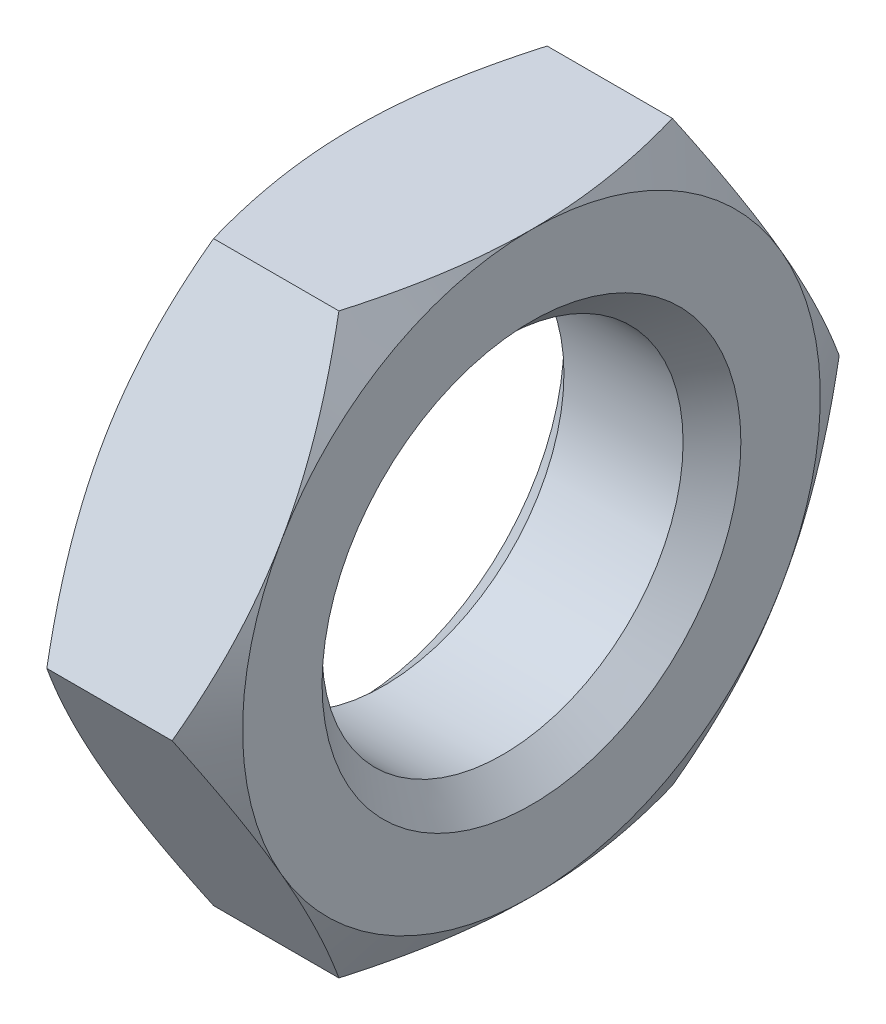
ISO-10303-21;
HEADER;
FILE_DESCRIPTION(('STEP AP214'),'2;1');
FILE_NAME('part.step','',(''),(''),'','','');
FILE_SCHEMA(('AUTOMOTIVE_DESIGN { 1 0 10303 214 1 1 1 1 }'));
ENDSEC;
DATA;
#1=APPLICATION_CONTEXT('core data for automotive mechanical design processes');
#2=APPLICATION_PROTOCOL_DEFINITION('international standard','automotive_design',2000,#1);
#3=PRODUCT_CONTEXT('',#1,'mechanical');
#4=PRODUCT('Part','Part','',(#3));
#5=PRODUCT_RELATED_PRODUCT_CATEGORY('part','',(#4));
#6=PRODUCT_DEFINITION_FORMATION('','',#4);
#7=PRODUCT_DEFINITION_CONTEXT('part definition',#1,'design');
#8=PRODUCT_DEFINITION('design','',#6,#7);
#9=PRODUCT_DEFINITION_SHAPE('','',#8);
#10=(LENGTH_UNIT() NAMED_UNIT(*) SI_UNIT(.MILLI.,.METRE.));
#11=(NAMED_UNIT(*) PLANE_ANGLE_UNIT() SI_UNIT($,.RADIAN.));
#12=(NAMED_UNIT(*) SI_UNIT($,.STERADIAN.) SOLID_ANGLE_UNIT());
#13=UNCERTAINTY_MEASURE_WITH_UNIT(LENGTH_MEASURE(1.E-05),#10,'distance_accuracy_value','');
#14=(GEOMETRIC_REPRESENTATION_CONTEXT(3) GLOBAL_UNCERTAINTY_ASSIGNED_CONTEXT((#13)) GLOBAL_UNIT_ASSIGNED_CONTEXT((#10,
#11,#12)) REPRESENTATION_CONTEXT('',''));
#15=CARTESIAN_POINT('',(0.,0.,0.));
#16=DIRECTION('',(0.,0.,1.));
#17=DIRECTION('',(1.,0.,0.));
#18=AXIS2_PLACEMENT_3D('',#15,#16,#17);
#19=CARTESIAN_POINT('',(2.45,4.,-2.3094010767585));
#20=DIRECTION('',(1.,0.,0.));
#21=DIRECTION('',(0.,0.,-1.));
#22=AXIS2_PLACEMENT_3D('',#19,#20,#21);
#23=PLANE('',#22);
#24=CARTESIAN_POINT('',(2.45,0.,0.));
#25=DIRECTION('',(1.,0.,0.));
#26=DIRECTION('',(0.,0.,-1.));
#27=AXIS2_PLACEMENT_3D('',#24,#25,#26);
#28=CIRCLE('',#27,2.9);
#29=CARTESIAN_POINT('',(2.45,0.,-2.9));
#30=VERTEX_POINT('',#29);
#31=EDGE_CURVE('E11',#30,#30,#28,.F.);
#32=ORIENTED_EDGE('',*,*,#31,.T.);
#33=EDGE_LOOP('',(#32));
#34=FACE_BOUND('',#33,.T.);
#35=CARTESIAN_POINT('',(2.45,0.,0.));
#36=DIRECTION('',(1.,0.,0.));
#37=DIRECTION('',(0.,0.,-1.));
#38=AXIS2_PLACEMENT_3D('',#35,#36,#37);
#39=CIRCLE('',#38,4.);
#40=CARTESIAN_POINT('',(2.45,-4.,0.));
#41=VERTEX_POINT('',#40);
#42=CARTESIAN_POINT('',(2.45,-2.,-3.46410161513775));
#43=VERTEX_POINT('',#42);
#44=EDGE_CURVE('E142',#41,#43,#39,.T.);
#45=ORIENTED_EDGE('',*,*,#44,.T.);
#46=CARTESIAN_POINT('',(2.45,2.,-3.46410161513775));
#47=VERTEX_POINT('',#46);
#48=EDGE_CURVE('E130',#43,#47,#39,.T.);
#49=ORIENTED_EDGE('',*,*,#48,.T.);
#50=CARTESIAN_POINT('',(2.45,4.,0.));
#51=VERTEX_POINT('',#50);
#52=EDGE_CURVE('E144',#47,#51,#39,.T.);
#53=ORIENTED_EDGE('',*,*,#52,.T.);
#54=CARTESIAN_POINT('',(2.45,2.,3.46410161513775));
#55=VERTEX_POINT('',#54);
#56=EDGE_CURVE('E55',#51,#55,#39,.T.);
#57=ORIENTED_EDGE('',*,*,#56,.T.);
#58=CARTESIAN_POINT('',(2.45,-2.,3.46410161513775));
#59=VERTEX_POINT('',#58);
#60=EDGE_CURVE('E63',#55,#59,#39,.T.);
#61=ORIENTED_EDGE('',*,*,#60,.T.);
#62=EDGE_CURVE('E166',#59,#41,#39,.T.);
#63=ORIENTED_EDGE('',*,*,#62,.T.);
#64=EDGE_LOOP('',(#45,#49,#53,#57,#61,#63));
#65=FACE_BOUND('',#64,.T.);
#66=ADVANCED_FACE('F39',(#34,#65),#23,.T.);
#67=CARTESIAN_POINT('',(0.,4.,-2.3094010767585));
#68=DIRECTION('',(1.,0.,0.));
#69=DIRECTION('',(0.,0.,-1.));
#70=AXIS2_PLACEMENT_3D('',#67,#68,#69);
#71=PLANE('',#70);
#72=CARTESIAN_POINT('',(0.,0.,0.));
#73=DIRECTION('',(1.,0.,0.));
#74=DIRECTION('',(0.,0.,-1.));
#75=AXIS2_PLACEMENT_3D('',#72,#73,#74);
#76=CIRCLE('',#75,2.9);
#77=CARTESIAN_POINT('',(0.,0.,-2.9));
#78=VERTEX_POINT('',#77);
#79=EDGE_CURVE('E164',#78,#78,#76,.T.);
#80=ORIENTED_EDGE('',*,*,#79,.T.);
#81=EDGE_LOOP('',(#80));
#82=FACE_BOUND('',#81,.T.);
#83=CARTESIAN_POINT('',(0.,0.,0.));
#84=DIRECTION('',(1.,0.,0.));
#85=DIRECTION('',(0.,0.,-1.));
#86=AXIS2_PLACEMENT_3D('',#83,#84,#85);
#87=CIRCLE('',#86,4.);
#88=CARTESIAN_POINT('',(0.,-2.,-3.46410161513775));
#89=VERTEX_POINT('',#88);
#90=CARTESIAN_POINT('',(0.,2.,-3.46410161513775));
#91=VERTEX_POINT('',#90);
#92=EDGE_CURVE('E173',#89,#91,#87,.T.);
#93=ORIENTED_EDGE('',*,*,#92,.F.);
#94=CARTESIAN_POINT('',(0.,-4.,0.));
#95=VERTEX_POINT('',#94);
#96=EDGE_CURVE('E319',#95,#89,#87,.T.);
#97=ORIENTED_EDGE('',*,*,#96,.F.);
#98=CARTESIAN_POINT('',(0.,-2.,3.46410161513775));
#99=VERTEX_POINT('',#98);
#100=EDGE_CURVE('E322',#99,#95,#87,.T.);
#101=ORIENTED_EDGE('',*,*,#100,.F.);
#102=CARTESIAN_POINT('',(0.,2.,3.46410161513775));
#103=VERTEX_POINT('',#102);
#104=EDGE_CURVE('E327',#103,#99,#87,.T.);
#105=ORIENTED_EDGE('',*,*,#104,.F.);
#106=CARTESIAN_POINT('',(0.,4.,0.));
#107=VERTEX_POINT('',#106);
#108=EDGE_CURVE('E178',#107,#103,#87,.T.);
#109=ORIENTED_EDGE('',*,*,#108,.F.);
#110=EDGE_CURVE('E174',#91,#107,#87,.T.);
#111=ORIENTED_EDGE('',*,*,#110,.F.);
#112=EDGE_LOOP('',(#93,#97,#101,#105,#109,#111));
#113=FACE_BOUND('',#112,.T.);
#114=ADVANCED_FACE('F320',(#82,#113),#71,.F.);
#115=CARTESIAN_POINT('',(2.45,0.,0.));
#116=DIRECTION('',(-1.,0.,0.));
#117=DIRECTION('',(0.,0.,1.));
#118=AXIS2_PLACEMENT_3D('',#115,#116,#117);
#119=CYLINDRICAL_SURFACE('',#118,2.5);
#120=CARTESIAN_POINT('',(0.400000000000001,0.,0.));
#121=DIRECTION('',(1.,0.,0.));
#122=DIRECTION('',(0.,0.,-1.));
#123=AXIS2_PLACEMENT_3D('',#120,#121,#122);
#124=CIRCLE('',#123,2.5);
#125=CARTESIAN_POINT('',(0.400000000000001,0.,-2.5));
#126=VERTEX_POINT('',#125);
#127=EDGE_CURVE('E48',#126,#126,#124,.F.);
#128=ORIENTED_EDGE('',*,*,#127,.T.);
#129=EDGE_LOOP('',(#128));
#130=FACE_BOUND('',#129,.T.);
#131=CARTESIAN_POINT('',(2.05,0.,0.));
#132=DIRECTION('',(1.,0.,0.));
#133=DIRECTION('',(0.,0.,-1.));
#134=AXIS2_PLACEMENT_3D('',#131,#132,#133);
#135=CIRCLE('',#134,2.5);
#136=CARTESIAN_POINT('',(2.05,0.,-2.5));
#137=VERTEX_POINT('',#136);
#138=EDGE_CURVE('E389',#137,#137,#135,.T.);
#139=ORIENTED_EDGE('',*,*,#138,.T.);
#140=EDGE_LOOP('',(#139));
#141=FACE_BOUND('',#140,.T.);
#142=ADVANCED_FACE('F234',(#130,#141),#119,.F.);
#143=CARTESIAN_POINT('',(0.,0.,0.));
#144=DIRECTION('',(1.,0.,0.));
#145=DIRECTION('',(0.,0.,-1.));
#146=AXIS2_PLACEMENT_3D('',#143,#144,#145);
#147=CONICAL_SURFACE('',#146,4.,1.0471975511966);
#148=CARTESIAN_POINT('',(0.357332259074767,-4.0002,-2.30928560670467));
#149=CARTESIAN_POINT('',(0.298717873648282,-3.82442084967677,-2.4107717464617));
#150=CARTESIAN_POINT('',(0.245410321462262,-3.64712438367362,-2.51313390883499));
#151=CARTESIAN_POINT('',(0.152361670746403,-3.28946140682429,-2.71963072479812));
#152=CARTESIAN_POINT('',(0.112653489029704,-3.10908854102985,-2.82376904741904));
#153=CARTESIAN_POINT('',(0.0508422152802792,-2.75057818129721,-3.03075510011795));
#154=CARTESIAN_POINT('',(0.0283277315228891,-2.57249584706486,-3.13357098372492));
#155=CARTESIAN_POINT('',(0.00145062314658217,-2.21549328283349,-3.33968651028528));
#156=CARTESIAN_POINT('',(-0.00293425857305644,-2.0365743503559,-3.44298540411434));
#157=CARTESIAN_POINT('',(0.00619007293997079,-1.70225715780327,-3.63600352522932));
#158=CARTESIAN_POINT('',(0.0174589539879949,-1.54680884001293,-3.72575165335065));
#159=CARTESIAN_POINT('',(0.053173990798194,-1.23692494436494,-3.90466320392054));
#160=CARTESIAN_POINT('',(0.0776323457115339,-1.08249043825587,-3.99382600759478));
#161=CARTESIAN_POINT('',(0.13877606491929,-0.771967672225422,-4.17310641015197));
#162=CARTESIAN_POINT('',(0.175720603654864,-0.615918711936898,-4.26320131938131));
#163=CARTESIAN_POINT('',(0.259570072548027,-0.306148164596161,-4.4420474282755));
#164=CARTESIAN_POINT('',(0.30645530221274,-0.152422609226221,-4.53080091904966));
#165=CARTESIAN_POINT('',(0.357332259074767,0.000199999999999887,-4.61891762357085));
#166=B_SPLINE_CURVE_WITH_KNOTS('',3,(#148,#149,#150,#151,#152,#153,#154,#155,#156,#157,#158,
#159,#160,#161,#162,#163,#164,#165),.UNSPECIFIED.,.F.,.F.,(4,2,2,2,2,2,2,2,4),(0.,
0.634047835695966,1.26961969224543,1.88946157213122,2.50854226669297,3.04757825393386,
3.58711366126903,4.13861653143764,4.68903648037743),.UNSPECIFIED.);
#167=CARTESIAN_POINT('',(0.357265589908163,0.,-4.61880215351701));
#168=VERTEX_POINT('',#167);
#169=EDGE_CURVE('E335',#89,#168,#166,.T.);
#170=ORIENTED_EDGE('',*,*,#169,.F.);
#171=ORIENTED_EDGE('',*,*,#92,.T.);
#172=CARTESIAN_POINT('',(0.357332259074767,-0.000200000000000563,-4.61891762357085));
#173=CARTESIAN_POINT('',(0.298717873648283,0.175579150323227,-4.51743148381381));
#174=CARTESIAN_POINT('',(0.245410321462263,0.35287561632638,-4.41506932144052));
#175=CARTESIAN_POINT('',(0.152361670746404,0.710538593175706,-4.2085725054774));
#176=CARTESIAN_POINT('',(0.112653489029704,0.89091145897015,-4.10443418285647));
#177=CARTESIAN_POINT('',(0.0508422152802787,1.24942181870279,-3.89744813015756));
#178=CARTESIAN_POINT('',(0.0283277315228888,1.42750415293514,-3.79463224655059));
#179=CARTESIAN_POINT('',(0.00145062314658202,1.78450671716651,-3.58851671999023));
#180=CARTESIAN_POINT('',(-0.00293425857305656,1.9634256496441,-3.48521782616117));
#181=CARTESIAN_POINT('',(0.0061900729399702,2.29774284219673,-3.29219970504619));
#182=CARTESIAN_POINT('',(0.0174589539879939,2.45319115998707,-3.20245157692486));
#183=CARTESIAN_POINT('',(0.0531739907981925,2.76307505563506,-3.02354002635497));
#184=CARTESIAN_POINT('',(0.0776323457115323,2.91750956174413,-2.93437722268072));
#185=CARTESIAN_POINT('',(0.138776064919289,3.22803232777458,-2.75509682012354));
#186=CARTESIAN_POINT('',(0.175720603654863,3.3840812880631,-2.6650019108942));
#187=CARTESIAN_POINT('',(0.259570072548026,3.69385183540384,-2.48615580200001));
#188=CARTESIAN_POINT('',(0.306455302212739,3.84757739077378,-2.39740231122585));
#189=CARTESIAN_POINT('',(0.357332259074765,4.0002,-2.30928560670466));
#190=B_SPLINE_CURVE_WITH_KNOTS('',3,(#172,#173,#174,#175,#176,#177,#178,#179,#180,#181,#182,
#183,#184,#185,#186,#187,#188,#189),.UNSPECIFIED.,.F.,.F.,(4,2,2,2,2,2,2,2,4),(0.,
0.634047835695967,1.26961969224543,1.88946157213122,2.50854226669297,3.04757825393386,
3.58711366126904,4.13861653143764,4.68903648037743),.UNSPECIFIED.);
#191=EDGE_CURVE('E215',#168,#91,#190,.T.);
#192=ORIENTED_EDGE('',*,*,#191,.F.);
#193=EDGE_LOOP('',(#170,#171,#192));
#194=FACE_BOUND('',#193,.T.);
#195=ADVANCED_FACE('F194',(#194),#147,.T.);
#196=ORIENTED_EDGE('',*,*,#96,.T.);
#197=CARTESIAN_POINT('',(0.357265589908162,-4.,-2.3094010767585));
#198=VERTEX_POINT('',#197);
#199=EDGE_CURVE('E156',#198,#89,#166,.T.);
#200=ORIENTED_EDGE('',*,*,#199,.F.);
#201=CARTESIAN_POINT('',(1.9728542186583,-4.,-6.24604925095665));
#202=CARTESIAN_POINT('',(1.88776121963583,-4.,-6.07098442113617));
#203=CARTESIAN_POINT('',(1.80347183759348,-4.,-5.89552228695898));
#204=CARTESIAN_POINT('',(1.63695141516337,-4.,-5.54359229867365));
#205=CARTESIAN_POINT('',(1.55472069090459,-4.,-5.36712429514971));
#206=CARTESIAN_POINT('',(1.39236406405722,-4.,-5.01208252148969));
#207=CARTESIAN_POINT('',(1.31225169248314,-4.,-4.83350254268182));
#208=CARTESIAN_POINT('',(1.15524865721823,-4.,-4.47493714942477));
#209=CARTESIAN_POINT('',(1.07835784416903,-4.,-4.29495180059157));
#210=CARTESIAN_POINT('',(0.926171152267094,-4.,-3.92730851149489));
#211=CARTESIAN_POINT('',(0.851012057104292,-4.,-3.73959364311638));
#212=CARTESIAN_POINT('',(0.706279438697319,-4.,-3.36198352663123));
#213=CARTESIAN_POINT('',(0.636706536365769,-4.,-3.17208803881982));
#214=CARTESIAN_POINT('',(0.504941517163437,-4.,-2.79015649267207));
#215=CARTESIAN_POINT('',(0.442734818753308,-4.,-2.59812551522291));
#216=CARTESIAN_POINT('',(0.327670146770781,-4.,-2.21130897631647));
#217=CARTESIAN_POINT('',(0.274809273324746,-4.,-2.0165242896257));
#218=CARTESIAN_POINT('',(0.181229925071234,-4.,-1.62518488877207));
#219=CARTESIAN_POINT('',(0.14044374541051,-4.,-1.42864666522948));
#220=CARTESIAN_POINT('',(0.0732864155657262,-4.,-1.03308153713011));
#221=CARTESIAN_POINT('',(0.046913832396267,-4.,-0.834054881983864));
#222=CARTESIAN_POINT('',(0.0110310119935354,-4.,-0.437123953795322));
#223=CARTESIAN_POINT('',(0.00130070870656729,-4.,-0.239240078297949));
#224=CARTESIAN_POINT('',(-0.00105456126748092,-4.,0.156646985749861));
#225=CARTESIAN_POINT('',(0.00632068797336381,-4.,0.354650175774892));
#226=CARTESIAN_POINT('',(0.0327353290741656,-4.,0.689547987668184));
#227=CARTESIAN_POINT('',(0.0475676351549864,-4.,0.826795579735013));
#228=CARTESIAN_POINT('',(0.0845503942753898,-4.,1.10030788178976));
#229=CARTESIAN_POINT('',(0.106701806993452,-4.,1.23657246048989));
#230=CARTESIAN_POINT('',(0.182972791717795,-4.,1.64369860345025));
#231=CARTESIAN_POINT('',(0.246895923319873,-4.,1.91274523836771));
#232=CARTESIAN_POINT('',(0.358016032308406,-4.,2.31509056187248));
#233=CARTESIAN_POINT('',(0.398118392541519,-4.,2.45046771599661));
#234=CARTESIAN_POINT('',(0.482557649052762,-4.,2.7199076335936));
#235=CARTESIAN_POINT('',(0.52689457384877,-4.,2.85397038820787));
#236=CARTESIAN_POINT('',(0.619085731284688,-4.,3.12082252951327));
#237=CARTESIAN_POINT('',(0.666938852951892,-4.,3.25361230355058));
#238=CARTESIAN_POINT('',(0.765592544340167,-4.,3.51808713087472));
#239=CARTESIAN_POINT('',(0.816393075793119,-4.,3.64977219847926));
#240=CARTESIAN_POINT('',(0.941692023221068,-4.,3.96571232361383));
#241=CARTESIAN_POINT('',(1.01740004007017,-4.,4.14948684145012));
#242=CARTESIAN_POINT('',(1.17263155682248,-4.,4.51542233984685));
#243=CARTESIAN_POINT('',(1.25215531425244,-4.,4.69758321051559));
#244=CARTESIAN_POINT('',(1.41423451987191,-4.,5.06059627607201));
#245=CARTESIAN_POINT('',(1.49679064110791,-4.,5.24144816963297));
#246=CARTESIAN_POINT('',(1.66431834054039,-4.,5.6020315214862));
#247=CARTESIAN_POINT('',(1.74928997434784,-4.,5.7817629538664));
#248=CARTESIAN_POINT('',(2.00730427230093,-4.,6.31997467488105));
#249=CARTESIAN_POINT('',(2.18325862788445,-4.,6.67705811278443));
#250=CARTESIAN_POINT('',(2.54034036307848,-4.,7.38855163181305));
#251=CARTESIAN_POINT('',(2.72146705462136,-4.,7.7429620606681));
#252=CARTESIAN_POINT('',(3.07151620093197,-4.,8.41921660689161));
#253=CARTESIAN_POINT('',(3.24013422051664,-4.,8.7412186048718));
#254=CARTESIAN_POINT('',(3.57966083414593,-4.,9.38402672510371));
#255=CARTESIAN_POINT('',(3.7505695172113,-4.,9.70483280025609));
#256=CARTESIAN_POINT('',(4.09367105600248,-4.,10.344663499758));
#257=CARTESIAN_POINT('',(4.26585931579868,-4.,10.6636905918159));
#258=CARTESIAN_POINT('',(4.61159585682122,-4.,11.3009829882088));
#259=CARTESIAN_POINT('',(4.78514405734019,-4.,11.6192483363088));
#260=CARTESIAN_POINT('',(4.9591976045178,-4.,11.937235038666));
#261=B_SPLINE_CURVE_WITH_KNOTS('',3,(#201,#202,#203,#204,#205,#206,#207,#208,#209,#210,#211,
#212,#213,#214,#215,#216,#217,#218,#219,#220,#221,#222,#223,#224,#225,#226,#227,#228,#229,#230,
#231,#232,#233,#234,#235,#236,#237,#238,#239,#240,#241,#242,#243,#244,#245,#246,#247,#248,#249,
#250,#251,#252,#253,#254,#255,#256,#257,#258,#259,#260),.UNSPECIFIED.,.F.,.F.,(4,2,2,2,2,2,2,2,
2,2,2,2,2,2,2,2,2,2,2,2,2,2,2,2,2,2,2,2,2,4),(0.,0.583956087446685,1.16800130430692,
1.75515482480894,2.34228109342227,2.94881918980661,3.55542461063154,4.16080842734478,
4.76600407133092,5.36773905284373,5.9694141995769,6.56306986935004,7.15673303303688,
7.57067316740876,7.98466759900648,8.81309821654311,9.2366372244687,9.66017908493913,
10.0835876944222,10.5069908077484,11.1032061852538,11.6994618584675,12.2958506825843,
12.8922532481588,14.086422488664,15.2804336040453,16.3708597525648,17.4613284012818,
18.5489109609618,19.6364294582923),.UNSPECIFIED.);
#262=EDGE_CURVE('E177',#95,#198,#261,.F.);
#263=ORIENTED_EDGE('',*,*,#262,.F.);
#264=EDGE_LOOP('',(#196,#200,#263));
#265=FACE_BOUND('',#264,.T.);
#266=ADVANCED_FACE('F352',(#265),#147,.T.);
#267=CARTESIAN_POINT('',(1.225,0.,0.));
#268=DIRECTION('',(-1.,0.,0.));
#269=DIRECTION('',(0.,0.,1.));
#270=AXIS2_PLACEMENT_3D('',#267,#268,#269);
#271=CONICAL_SURFACE('',#270,6.12176223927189,1.0471975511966);
#272=CARTESIAN_POINT('',(2.09266774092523,0.000199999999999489,-4.61891762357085));
#273=CARTESIAN_POINT('',(2.15128212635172,-0.175579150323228,-4.51743148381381));
#274=CARTESIAN_POINT('',(2.20458967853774,-0.352875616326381,-4.41506932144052));
#275=CARTESIAN_POINT('',(2.2976383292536,-0.710538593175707,-4.2085725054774));
#276=CARTESIAN_POINT('',(2.3373465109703,-0.890911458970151,-4.10443418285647));
#277=CARTESIAN_POINT('',(2.39915778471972,-1.24942181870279,-3.89744813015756));
#278=CARTESIAN_POINT('',(2.42167226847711,-1.42750415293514,-3.79463224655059));
#279=CARTESIAN_POINT('',(2.44854937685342,-1.78450671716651,-3.58851671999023));
#280=CARTESIAN_POINT('',(2.45293425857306,-1.9634256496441,-3.48521782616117));
#281=CARTESIAN_POINT('',(2.44380992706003,-2.29774284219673,-3.29219970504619));
#282=CARTESIAN_POINT('',(2.43254104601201,-2.45319115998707,-3.20245157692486));
#283=CARTESIAN_POINT('',(2.39682600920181,-2.76307505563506,-3.02354002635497));
#284=CARTESIAN_POINT('',(2.37236765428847,-2.91750956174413,-2.93437722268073));
#285=CARTESIAN_POINT('',(2.31122393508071,-3.22803232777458,-2.75509682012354));
#286=CARTESIAN_POINT('',(2.27427939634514,-3.3840812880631,-2.6650019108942));
#287=CARTESIAN_POINT('',(2.19042992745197,-3.69385183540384,-2.48615580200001));
#288=CARTESIAN_POINT('',(2.14354469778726,-3.84757739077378,-2.39740231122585));
#289=CARTESIAN_POINT('',(2.09266774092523,-4.0002,-2.30928560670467));
#290=B_SPLINE_CURVE_WITH_KNOTS('',3,(#272,#273,#274,#275,#276,#277,#278,#279,#280,#281,#282,
#283,#284,#285,#286,#287,#288,#289),.UNSPECIFIED.,.F.,.F.,(4,2,2,2,2,2,2,2,4),(0.,
0.634047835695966,1.26961969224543,1.88946157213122,2.50854226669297,3.04757825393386,
3.58711366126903,4.13861653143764,4.68903648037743),.UNSPECIFIED.);
#291=CARTESIAN_POINT('',(2.09273441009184,-4.,-2.3094010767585));
#292=VERTEX_POINT('',#291);
#293=EDGE_CURVE('E147',#43,#292,#290,.T.);
#294=ORIENTED_EDGE('',*,*,#293,.F.);
#295=ORIENTED_EDGE('',*,*,#44,.F.);
#296=CARTESIAN_POINT('',(0.477145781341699,-4.,-6.24604925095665));
#297=CARTESIAN_POINT('',(0.562238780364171,-4.,-6.07098442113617));
#298=CARTESIAN_POINT('',(0.646528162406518,-4.,-5.89552228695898));
#299=CARTESIAN_POINT('',(0.813048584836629,-4.,-5.54359229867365));
#300=CARTESIAN_POINT('',(0.89527930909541,-4.,-5.36712429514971));
#301=CARTESIAN_POINT('',(1.05763593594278,-4.,-5.01208252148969));
#302=CARTESIAN_POINT('',(1.13774830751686,-4.,-4.83350254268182));
#303=CARTESIAN_POINT('',(1.29475134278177,-4.,-4.47493714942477));
#304=CARTESIAN_POINT('',(1.37164215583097,-4.,-4.29495180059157));
#305=CARTESIAN_POINT('',(1.52382884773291,-4.,-3.92730851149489));
#306=CARTESIAN_POINT('',(1.59898794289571,-4.,-3.73959364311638));
#307=CARTESIAN_POINT('',(1.74372056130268,-4.,-3.36198352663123));
#308=CARTESIAN_POINT('',(1.81329346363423,-4.,-3.17208803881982));
#309=CARTESIAN_POINT('',(1.94505848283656,-4.,-2.79015649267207));
#310=CARTESIAN_POINT('',(2.00726518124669,-4.,-2.59812551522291));
#311=CARTESIAN_POINT('',(2.12232985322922,-4.,-2.21130897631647));
#312=CARTESIAN_POINT('',(2.17519072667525,-4.,-2.0165242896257));
#313=CARTESIAN_POINT('',(2.26877007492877,-4.,-1.62518488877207));
#314=CARTESIAN_POINT('',(2.30955625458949,-4.,-1.42864666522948));
#315=CARTESIAN_POINT('',(2.37671358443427,-4.,-1.03308153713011));
#316=CARTESIAN_POINT('',(2.40308616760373,-4.,-0.834054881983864));
#317=CARTESIAN_POINT('',(2.43896898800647,-4.,-0.437123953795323));
#318=CARTESIAN_POINT('',(2.44869929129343,-4.,-0.239240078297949));
#319=CARTESIAN_POINT('',(2.45105456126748,-4.,0.15664698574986));
#320=CARTESIAN_POINT('',(2.44367931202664,-4.,0.354650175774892));
#321=CARTESIAN_POINT('',(2.41726467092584,-4.,0.689547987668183));
#322=CARTESIAN_POINT('',(2.40243236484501,-4.,0.826795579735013));
#323=CARTESIAN_POINT('',(2.36544960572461,-4.,1.10030788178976));
#324=CARTESIAN_POINT('',(2.34329819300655,-4.,1.23657246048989));
#325=CARTESIAN_POINT('',(2.2670272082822,-4.,1.64369860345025));
#326=CARTESIAN_POINT('',(2.20310407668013,-4.,1.91274523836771));
#327=CARTESIAN_POINT('',(2.09198396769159,-4.,2.31509056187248));
#328=CARTESIAN_POINT('',(2.05188160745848,-4.,2.45046771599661));
#329=CARTESIAN_POINT('',(1.96744235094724,-4.,2.7199076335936));
#330=CARTESIAN_POINT('',(1.92310542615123,-4.,2.85397038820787));
#331=CARTESIAN_POINT('',(1.83091426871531,-4.,3.12082252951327));
#332=CARTESIAN_POINT('',(1.78306114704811,-4.,3.25361230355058));
#333=CARTESIAN_POINT('',(1.68440745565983,-4.,3.51808713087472));
#334=CARTESIAN_POINT('',(1.63360692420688,-4.,3.64977219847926));
#335=CARTESIAN_POINT('',(1.50830797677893,-4.,3.96571232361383));
#336=CARTESIAN_POINT('',(1.43259995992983,-4.,4.14948684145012));
#337=CARTESIAN_POINT('',(1.27736844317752,-4.,4.51542233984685));
#338=CARTESIAN_POINT('',(1.19784468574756,-4.,4.69758321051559));
#339=CARTESIAN_POINT('',(1.03576548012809,-4.,5.06059627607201));
#340=CARTESIAN_POINT('',(0.953209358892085,-4.,5.24144816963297));
#341=CARTESIAN_POINT('',(0.785681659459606,-4.,5.6020315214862));
#342=CARTESIAN_POINT('',(0.700710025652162,-4.,5.7817629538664));
#343=CARTESIAN_POINT('',(0.442695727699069,-4.,6.31997467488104));
#344=CARTESIAN_POINT('',(0.266741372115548,-4.,6.67705811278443));
#345=CARTESIAN_POINT('',(-0.0903403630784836,-4.,7.38855163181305));
#346=CARTESIAN_POINT('',(-0.27146705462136,-4.,7.7429620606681));
#347=CARTESIAN_POINT('',(-0.621516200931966,-4.,8.41921660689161));
#348=CARTESIAN_POINT('',(-0.790134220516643,-4.,8.7412186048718));
#349=CARTESIAN_POINT('',(-1.12966083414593,-4.,9.38402672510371));
#350=CARTESIAN_POINT('',(-1.30056951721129,-4.,9.70483280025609));
#351=CARTESIAN_POINT('',(-1.64367105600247,-4.,10.344663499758));
#352=CARTESIAN_POINT('',(-1.81585931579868,-4.,10.6636905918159));
#353=CARTESIAN_POINT('',(-2.16159585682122,-4.,11.3009829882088));
#354=CARTESIAN_POINT('',(-2.33514405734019,-4.,11.6192483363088));
#355=CARTESIAN_POINT('',(-2.5091976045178,-4.,11.937235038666));
#356=B_SPLINE_CURVE_WITH_KNOTS('',3,(#296,#297,#298,#299,#300,#301,#302,#303,#304,#305,#306,
#307,#308,#309,#310,#311,#312,#313,#314,#315,#316,#317,#318,#319,#320,#321,#322,#323,#324,#325,
#326,#327,#328,#329,#330,#331,#332,#333,#334,#335,#336,#337,#338,#339,#340,#341,#342,#343,#344,
#345,#346,#347,#348,#349,#350,#351,#352,#353,#354,#355),.UNSPECIFIED.,.F.,.F.,(4,2,2,2,2,2,2,2,
2,2,2,2,2,2,2,2,2,2,2,2,2,2,2,2,2,2,2,2,2,4),(0.,0.583956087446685,1.16800130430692,
1.75515482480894,2.34228109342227,2.9488191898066,3.55542461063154,4.16080842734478,
4.76600407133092,5.36773905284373,5.9694141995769,6.56306986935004,7.15673303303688,
7.57067316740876,7.98466759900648,8.81309821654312,9.2366372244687,9.66017908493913,
10.0835876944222,10.5069908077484,11.1032061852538,11.6994618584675,12.2958506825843,
12.8922532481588,14.086422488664,15.2804336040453,16.3708597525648,17.4613284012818,
18.5489109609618,19.6364294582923),.UNSPECIFIED.);
#357=EDGE_CURVE('E151',#292,#41,#356,.T.);
#358=ORIENTED_EDGE('',*,*,#357,.F.);
#359=EDGE_LOOP('',(#294,#295,#358));
#360=FACE_BOUND('',#359,.T.);
#361=ADVANCED_FACE('F148',(#360),#271,.T.);
#362=ORIENTED_EDGE('',*,*,#48,.F.);
#363=CARTESIAN_POINT('',(2.09273441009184,0.,-4.61880215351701));
#364=VERTEX_POINT('',#363);
#365=EDGE_CURVE('E134',#364,#43,#290,.T.);
#366=ORIENTED_EDGE('',*,*,#365,.F.);
#367=CARTESIAN_POINT('',(2.09266774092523,4.0002,-2.30928560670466));
#368=CARTESIAN_POINT('',(2.15128212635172,3.82442084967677,-2.4107717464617));
#369=CARTESIAN_POINT('',(2.20458967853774,3.64712438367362,-2.51313390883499));
#370=CARTESIAN_POINT('',(2.2976383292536,3.28946140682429,-2.71963072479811));
#371=CARTESIAN_POINT('',(2.3373465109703,3.10908854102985,-2.82376904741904));
#372=CARTESIAN_POINT('',(2.39915778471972,2.75057818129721,-3.03075510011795));
#373=CARTESIAN_POINT('',(2.42167226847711,2.57249584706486,-3.13357098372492));
#374=CARTESIAN_POINT('',(2.44854937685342,2.21549328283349,-3.33968651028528));
#375=CARTESIAN_POINT('',(2.45293425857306,2.0365743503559,-3.44298540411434));
#376=CARTESIAN_POINT('',(2.44380992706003,1.70225715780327,-3.63600352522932));
#377=CARTESIAN_POINT('',(2.43254104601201,1.54680884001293,-3.72575165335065));
#378=CARTESIAN_POINT('',(2.39682600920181,1.23692494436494,-3.90466320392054));
#379=CARTESIAN_POINT('',(2.37236765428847,1.08249043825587,-3.99382600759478));
#380=CARTESIAN_POINT('',(2.31122393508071,0.771967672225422,-4.17310641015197));
#381=CARTESIAN_POINT('',(2.27427939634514,0.615918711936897,-4.26320131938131));
#382=CARTESIAN_POINT('',(2.19042992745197,0.30614816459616,-4.4420474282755));
#383=CARTESIAN_POINT('',(2.14354469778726,0.15242260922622,-4.53080091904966));
#384=CARTESIAN_POINT('',(2.09266774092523,-0.000200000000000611,-4.61891762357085));
#385=B_SPLINE_CURVE_WITH_KNOTS('',3,(#367,#368,#369,#370,#371,#372,#373,#374,#375,#376,#377,
#378,#379,#380,#381,#382,#383,#384),.UNSPECIFIED.,.F.,.F.,(4,2,2,2,2,2,2,2,4),(0.,
0.634047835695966,1.26961969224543,1.88946157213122,2.50854226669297,3.04757825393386,
3.58711366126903,4.13861653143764,4.68903648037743),.UNSPECIFIED.);
#386=EDGE_CURVE('E136',#47,#364,#385,.T.);
#387=ORIENTED_EDGE('',*,*,#386,.F.);
#388=EDGE_LOOP('',(#362,#366,#387));
#389=FACE_BOUND('',#388,.T.);
#390=ADVANCED_FACE('F132',(#389),#271,.T.);
#391=ORIENTED_EDGE('',*,*,#100,.T.);
#392=CARTESIAN_POINT('',(0.357265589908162,-4.,2.3094010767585));
#393=VERTEX_POINT('',#392);
#394=EDGE_CURVE('E187',#393,#95,#261,.F.);
#395=ORIENTED_EDGE('',*,*,#394,.F.);
#396=CARTESIAN_POINT('',(0.357332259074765,0.000200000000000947,4.61891762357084));
#397=CARTESIAN_POINT('',(0.298717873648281,-0.175579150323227,4.5174314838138));
#398=CARTESIAN_POINT('',(0.245410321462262,-0.35287561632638,4.41506932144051));
#399=CARTESIAN_POINT('',(0.152361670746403,-0.710538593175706,4.20857250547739));
#400=CARTESIAN_POINT('',(0.112653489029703,-0.89091145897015,4.10443418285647));
#401=CARTESIAN_POINT('',(0.0508422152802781,-1.24942181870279,3.89744813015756));
#402=CARTESIAN_POINT('',(0.0283277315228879,-1.42750415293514,3.79463224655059));
#403=CARTESIAN_POINT('',(0.0014506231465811,-1.78450671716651,3.58851671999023));
#404=CARTESIAN_POINT('',(-0.00293425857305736,-1.9634256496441,3.48521782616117));
#405=CARTESIAN_POINT('',(0.0061900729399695,-2.29774284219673,3.29219970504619));
#406=CARTESIAN_POINT('',(0.0174589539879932,-2.45319115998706,3.20245157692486));
#407=CARTESIAN_POINT('',(0.0531739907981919,-2.76307505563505,3.02354002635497));
#408=CARTESIAN_POINT('',(0.0776323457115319,-2.91750956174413,2.93437722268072));
#409=CARTESIAN_POINT('',(0.138776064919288,-3.22803232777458,2.75509682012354));
#410=CARTESIAN_POINT('',(0.175720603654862,-3.3840812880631,2.6650019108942));
#411=CARTESIAN_POINT('',(0.259570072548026,-3.69385183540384,2.48615580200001));
#412=CARTESIAN_POINT('',(0.306455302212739,-3.84757739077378,2.39740231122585));
#413=CARTESIAN_POINT('',(0.357332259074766,-4.0002,2.30928560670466));
#414=B_SPLINE_CURVE_WITH_KNOTS('',3,(#396,#397,#398,#399,#400,#401,#402,#403,#404,#405,#406,
#407,#408,#409,#410,#411,#412,#413),.UNSPECIFIED.,.F.,.F.,(4,2,2,2,2,2,2,2,4),(0.,
0.634047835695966,1.26961969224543,1.88946157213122,2.50854226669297,3.04757825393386,
3.58711366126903,4.13861653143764,4.68903648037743),.UNSPECIFIED.);
#415=EDGE_CURVE('E188',#99,#393,#414,.T.);
#416=ORIENTED_EDGE('',*,*,#415,.F.);
#417=EDGE_LOOP('',(#391,#395,#416));
#418=FACE_BOUND('',#417,.T.);
#419=ADVANCED_FACE('F351',(#418),#147,.T.);
#420=CARTESIAN_POINT('',(2.09273441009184,-4.,2.3094010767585));
#421=VERTEX_POINT('',#420);
#422=EDGE_CURVE('E216',#41,#421,#356,.T.);
#423=ORIENTED_EDGE('',*,*,#422,.F.);
#424=ORIENTED_EDGE('',*,*,#62,.F.);
#425=CARTESIAN_POINT('',(2.09266774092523,-4.0002,2.30928560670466));
#426=CARTESIAN_POINT('',(2.15128212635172,-3.82442084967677,2.4107717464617));
#427=CARTESIAN_POINT('',(2.20458967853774,-3.64712438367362,2.51313390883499));
#428=CARTESIAN_POINT('',(2.2976383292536,-3.28946140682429,2.71963072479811));
#429=CARTESIAN_POINT('',(2.3373465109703,-3.10908854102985,2.82376904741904));
#430=CARTESIAN_POINT('',(2.39915778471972,-2.75057818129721,3.03075510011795));
#431=CARTESIAN_POINT('',(2.42167226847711,-2.57249584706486,3.13357098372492));
#432=CARTESIAN_POINT('',(2.44854937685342,-2.21549328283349,3.33968651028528));
#433=CARTESIAN_POINT('',(2.45293425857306,-2.0365743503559,3.44298540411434));
#434=CARTESIAN_POINT('',(2.44380992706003,-1.70225715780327,3.63600352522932));
#435=CARTESIAN_POINT('',(2.43254104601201,-1.54680884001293,3.72575165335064));
#436=CARTESIAN_POINT('',(2.39682600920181,-1.23692494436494,3.90466320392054));
#437=CARTESIAN_POINT('',(2.37236765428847,-1.08249043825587,3.99382600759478));
#438=CARTESIAN_POINT('',(2.31122393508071,-0.771967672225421,4.17310641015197));
#439=CARTESIAN_POINT('',(2.27427939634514,-0.615918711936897,4.26320131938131));
#440=CARTESIAN_POINT('',(2.19042992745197,-0.30614816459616,4.4420474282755));
#441=CARTESIAN_POINT('',(2.14354469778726,-0.15242260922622,4.53080091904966));
#442=CARTESIAN_POINT('',(2.09266774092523,0.000200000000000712,4.61891762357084));
#443=B_SPLINE_CURVE_WITH_KNOTS('',3,(#425,#426,#427,#428,#429,#430,#431,#432,#433,#434,#435,
#436,#437,#438,#439,#440,#441,#442),.UNSPECIFIED.,.F.,.F.,(4,2,2,2,2,2,2,2,4),(0.,
0.634047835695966,1.26961969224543,1.88946157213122,2.50854226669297,3.04757825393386,
3.58711366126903,4.13861653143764,4.68903648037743),.UNSPECIFIED.);
#444=EDGE_CURVE('E247',#421,#59,#443,.T.);
#445=ORIENTED_EDGE('',*,*,#444,.F.);
#446=EDGE_LOOP('',(#423,#424,#445));
#447=FACE_BOUND('',#446,.T.);
#448=ADVANCED_FACE('F431',(#447),#271,.T.);
#449=ORIENTED_EDGE('',*,*,#104,.T.);
#450=CARTESIAN_POINT('',(0.357265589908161,0.,4.618802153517));
#451=VERTEX_POINT('',#450);
#452=EDGE_CURVE('E288',#451,#99,#414,.T.);
#453=ORIENTED_EDGE('',*,*,#452,.F.);
#454=CARTESIAN_POINT('',(0.357332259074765,4.0002,2.30928560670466));
#455=CARTESIAN_POINT('',(0.298717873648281,3.82442084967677,2.4107717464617));
#456=CARTESIAN_POINT('',(0.245410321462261,3.64712438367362,2.51313390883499));
#457=CARTESIAN_POINT('',(0.152361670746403,3.28946140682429,2.71963072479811));
#458=CARTESIAN_POINT('',(0.112653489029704,3.10908854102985,2.82376904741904));
#459=CARTESIAN_POINT('',(0.0508422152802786,2.75057818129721,3.03075510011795));
#460=CARTESIAN_POINT('',(0.0283277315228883,2.57249584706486,3.13357098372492));
#461=CARTESIAN_POINT('',(0.00145062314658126,2.21549328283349,3.33968651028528));
#462=CARTESIAN_POINT('',(-0.0029342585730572,2.0365743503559,3.44298540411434));
#463=CARTESIAN_POINT('',(0.00619007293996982,1.70225715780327,3.63600352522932));
#464=CARTESIAN_POINT('',(0.0174589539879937,1.54680884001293,3.72575165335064));
#465=CARTESIAN_POINT('',(0.0531739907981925,1.23692494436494,3.90466320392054));
#466=CARTESIAN_POINT('',(0.0776323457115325,1.08249043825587,3.99382600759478));
#467=CARTESIAN_POINT('',(0.138776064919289,0.771967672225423,4.17310641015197));
#468=CARTESIAN_POINT('',(0.175720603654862,0.615918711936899,4.26320131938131));
#469=CARTESIAN_POINT('',(0.259570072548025,0.306148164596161,4.4420474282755));
#470=CARTESIAN_POINT('',(0.306455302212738,0.152422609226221,4.53080091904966));
#471=CARTESIAN_POINT('',(0.357332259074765,-0.000199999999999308,4.61891762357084));
#472=B_SPLINE_CURVE_WITH_KNOTS('',3,(#454,#455,#456,#457,#458,#459,#460,#461,#462,#463,#464,
#465,#466,#467,#468,#469,#470,#471),.UNSPECIFIED.,.F.,.F.,(4,2,2,2,2,2,2,2,4),(0.,
0.634047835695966,1.26961969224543,1.88946157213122,2.50854226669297,3.04757825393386,
3.58711366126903,4.13861653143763,4.68903648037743),.UNSPECIFIED.);
#473=EDGE_CURVE('E282',#103,#451,#472,.T.);
#474=ORIENTED_EDGE('',*,*,#473,.F.);
#475=EDGE_LOOP('',(#449,#453,#474));
#476=FACE_BOUND('',#475,.T.);
#477=ADVANCED_FACE('F232',(#476),#147,.T.);
#478=CARTESIAN_POINT('',(2.09273441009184,0.,4.618802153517));
#479=VERTEX_POINT('',#478);
#480=EDGE_CURVE('E375',#59,#479,#443,.T.);
#481=ORIENTED_EDGE('',*,*,#480,.F.);
#482=ORIENTED_EDGE('',*,*,#60,.F.);
#483=CARTESIAN_POINT('',(2.09266774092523,-0.000199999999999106,4.61891762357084));
#484=CARTESIAN_POINT('',(2.15128212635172,0.175579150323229,4.5174314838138));
#485=CARTESIAN_POINT('',(2.20458967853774,0.352875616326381,4.41506932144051));
#486=CARTESIAN_POINT('',(2.2976383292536,0.710538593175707,4.20857250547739));
#487=CARTESIAN_POINT('',(2.3373465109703,0.890911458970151,4.10443418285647));
#488=CARTESIAN_POINT('',(2.39915778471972,1.24942181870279,3.89744813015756));
#489=CARTESIAN_POINT('',(2.42167226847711,1.42750415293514,3.79463224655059));
#490=CARTESIAN_POINT('',(2.44854937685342,1.78450671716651,3.58851671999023));
#491=CARTESIAN_POINT('',(2.45293425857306,1.9634256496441,3.48521782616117));
#492=CARTESIAN_POINT('',(2.44380992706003,2.29774284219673,3.29219970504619));
#493=CARTESIAN_POINT('',(2.43254104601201,2.45319115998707,3.20245157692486));
#494=CARTESIAN_POINT('',(2.39682600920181,2.76307505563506,3.02354002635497));
#495=CARTESIAN_POINT('',(2.37236765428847,2.91750956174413,2.93437722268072));
#496=CARTESIAN_POINT('',(2.31122393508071,3.22803232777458,2.75509682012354));
#497=CARTESIAN_POINT('',(2.27427939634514,3.3840812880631,2.6650019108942));
#498=CARTESIAN_POINT('',(2.19042992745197,3.69385183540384,2.48615580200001));
#499=CARTESIAN_POINT('',(2.14354469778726,3.84757739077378,2.39740231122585));
#500=CARTESIAN_POINT('',(2.09266774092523,4.0002,2.30928560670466));
#501=B_SPLINE_CURVE_WITH_KNOTS('',3,(#483,#484,#485,#486,#487,#488,#489,#490,#491,#492,#493,
#494,#495,#496,#497,#498,#499,#500),.UNSPECIFIED.,.F.,.F.,(4,2,2,2,2,2,2,2,4),(0.,
0.634047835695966,1.26961969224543,1.88946157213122,2.50854226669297,3.04757825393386,
3.58711366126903,4.13861653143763,4.68903648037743),.UNSPECIFIED.);
#502=EDGE_CURVE('E371',#479,#55,#501,.T.);
#503=ORIENTED_EDGE('',*,*,#502,.F.);
#504=EDGE_LOOP('',(#481,#482,#503));
#505=FACE_BOUND('',#504,.T.);
#506=ADVANCED_FACE('F227',(#505),#271,.T.);
#507=ORIENTED_EDGE('',*,*,#108,.T.);
#508=CARTESIAN_POINT('',(0.357265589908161,4.,2.3094010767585));
#509=VERTEX_POINT('',#508);
#510=EDGE_CURVE('E281',#509,#103,#472,.T.);
#511=ORIENTED_EDGE('',*,*,#510,.F.);
#512=CARTESIAN_POINT('',(1.9728542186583,4.,-6.24604925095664));
#513=CARTESIAN_POINT('',(1.88776121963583,4.,-6.07098442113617));
#514=CARTESIAN_POINT('',(1.80347183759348,4.,-5.89552228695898));
#515=CARTESIAN_POINT('',(1.63695141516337,4.,-5.54359229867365));
#516=CARTESIAN_POINT('',(1.55472069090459,4.,-5.36712429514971));
#517=CARTESIAN_POINT('',(1.39236406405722,4.,-5.01208252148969));
#518=CARTESIAN_POINT('',(1.31225169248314,4.,-4.83350254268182));
#519=CARTESIAN_POINT('',(1.15524865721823,4.,-4.47493714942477));
#520=CARTESIAN_POINT('',(1.07835784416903,4.,-4.29495180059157));
#521=CARTESIAN_POINT('',(0.926171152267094,4.,-3.92730851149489));
#522=CARTESIAN_POINT('',(0.851012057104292,4.,-3.73959364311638));
#523=CARTESIAN_POINT('',(0.706279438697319,4.,-3.36198352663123));
#524=CARTESIAN_POINT('',(0.636706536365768,4.,-3.17208803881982));
#525=CARTESIAN_POINT('',(0.504941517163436,4.,-2.79015649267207));
#526=CARTESIAN_POINT('',(0.442734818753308,4.,-2.59812551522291));
#527=CARTESIAN_POINT('',(0.327670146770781,4.,-2.21130897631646));
#528=CARTESIAN_POINT('',(0.274809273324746,4.,-2.0165242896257));
#529=CARTESIAN_POINT('',(0.181229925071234,4.,-1.62518488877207));
#530=CARTESIAN_POINT('',(0.14044374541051,4.,-1.42864666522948));
#531=CARTESIAN_POINT('',(0.0732864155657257,4.,-1.03308153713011));
#532=CARTESIAN_POINT('',(0.0469138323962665,4.,-0.834054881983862));
#533=CARTESIAN_POINT('',(0.011031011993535,4.,-0.437123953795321));
#534=CARTESIAN_POINT('',(0.00130070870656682,4.,-0.239240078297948));
#535=CARTESIAN_POINT('',(-0.00105456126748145,4.,0.156646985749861));
#536=CARTESIAN_POINT('',(0.0063206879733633,4.,0.354650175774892));
#537=CARTESIAN_POINT('',(0.0327353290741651,4.,0.689547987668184));
#538=CARTESIAN_POINT('',(0.0475676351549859,4.,0.826795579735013));
#539=CARTESIAN_POINT('',(0.0845503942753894,4.,1.10030788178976));
#540=CARTESIAN_POINT('',(0.106701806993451,4.,1.23657246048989));
#541=CARTESIAN_POINT('',(0.182972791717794,4.,1.64369860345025));
#542=CARTESIAN_POINT('',(0.246895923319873,4.,1.91274523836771));
#543=CARTESIAN_POINT('',(0.358016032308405,4.,2.31509056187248));
#544=CARTESIAN_POINT('',(0.398118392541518,4.,2.45046771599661));
#545=CARTESIAN_POINT('',(0.482557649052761,4.,2.7199076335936));
#546=CARTESIAN_POINT('',(0.526894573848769,4.,2.85397038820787));
#547=CARTESIAN_POINT('',(0.619085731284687,4.,3.12082252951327));
#548=CARTESIAN_POINT('',(0.666938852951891,4.,3.25361230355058));
#549=CARTESIAN_POINT('',(0.765592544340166,4.,3.51808713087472));
#550=CARTESIAN_POINT('',(0.816393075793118,4.,3.64977219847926));
#551=CARTESIAN_POINT('',(0.941692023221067,4.,3.96571232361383));
#552=CARTESIAN_POINT('',(1.01740004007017,4.,4.14948684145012));
#553=CARTESIAN_POINT('',(1.17263155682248,4.,4.51542233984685));
#554=CARTESIAN_POINT('',(1.25215531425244,4.,4.69758321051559));
#555=CARTESIAN_POINT('',(1.41423451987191,4.,5.06059627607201));
#556=CARTESIAN_POINT('',(1.49679064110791,4.,5.24144816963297));
#557=CARTESIAN_POINT('',(1.66431834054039,4.,5.6020315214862));
#558=CARTESIAN_POINT('',(1.74928997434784,4.,5.7817629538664));
#559=CARTESIAN_POINT('',(2.00730427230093,4.,6.31997467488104));
#560=CARTESIAN_POINT('',(2.18325862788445,4.,6.67705811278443));
#561=CARTESIAN_POINT('',(2.54034036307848,4.,7.38855163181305));
#562=CARTESIAN_POINT('',(2.72146705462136,4.,7.7429620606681));
#563=CARTESIAN_POINT('',(3.07151620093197,4.,8.41921660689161));
#564=CARTESIAN_POINT('',(3.24013422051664,4.,8.7412186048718));
#565=CARTESIAN_POINT('',(3.57966083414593,4.,9.38402672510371));
#566=CARTESIAN_POINT('',(3.7505695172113,4.,9.70483280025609));
#567=CARTESIAN_POINT('',(4.09367105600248,4.,10.344663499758));
#568=CARTESIAN_POINT('',(4.26585931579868,4.,10.6636905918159));
#569=CARTESIAN_POINT('',(4.61159585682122,4.,11.3009829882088));
#570=CARTESIAN_POINT('',(4.78514405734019,4.,11.6192483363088));
#571=CARTESIAN_POINT('',(4.9591976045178,4.,11.937235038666));
#572=B_SPLINE_CURVE_WITH_KNOTS('',3,(#512,#513,#514,#515,#516,#517,#518,#519,#520,#521,#522,
#523,#524,#525,#526,#527,#528,#529,#530,#531,#532,#533,#534,#535,#536,#537,#538,#539,#540,#541,
#542,#543,#544,#545,#546,#547,#548,#549,#550,#551,#552,#553,#554,#555,#556,#557,#558,#559,#560,
#561,#562,#563,#564,#565,#566,#567,#568,#569,#570,#571),.UNSPECIFIED.,.F.,.F.,(4,2,2,2,2,2,2,2,
2,2,2,2,2,2,2,2,2,2,2,2,2,2,2,2,2,2,2,2,2,4),(0.,0.583956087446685,1.16800130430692,
1.75515482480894,2.34228109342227,2.9488191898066,3.55542461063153,4.16080842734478,
4.76600407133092,5.36773905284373,5.9694141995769,6.56306986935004,7.15673303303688,
7.57067316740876,7.98466759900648,8.81309821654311,9.23663722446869,9.66017908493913,
10.0835876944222,10.5069908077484,11.1032061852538,11.6994618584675,12.2958506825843,
12.8922532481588,14.086422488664,15.2804336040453,16.3708597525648,17.4613284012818,
18.5489109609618,19.6364294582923),.UNSPECIFIED.);
#573=EDGE_CURVE('E274',#107,#509,#572,.T.);
#574=ORIENTED_EDGE('',*,*,#573,.F.);
#575=EDGE_LOOP('',(#507,#511,#574));
#576=FACE_BOUND('',#575,.T.);
#577=ADVANCED_FACE('F231',(#576),#147,.T.);
#578=ORIENTED_EDGE('',*,*,#56,.F.);
#579=CARTESIAN_POINT('',(0.4771457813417,4.,-6.24604925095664));
#580=CARTESIAN_POINT('',(0.562238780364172,4.,-6.07098442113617));
#581=CARTESIAN_POINT('',(0.646528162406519,4.,-5.89552228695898));
#582=CARTESIAN_POINT('',(0.81304858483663,4.,-5.54359229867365));
#583=CARTESIAN_POINT('',(0.89527930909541,4.,-5.36712429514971));
#584=CARTESIAN_POINT('',(1.05763593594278,4.,-5.01208252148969));
#585=CARTESIAN_POINT('',(1.13774830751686,4.,-4.83350254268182));
#586=CARTESIAN_POINT('',(1.29475134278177,4.,-4.47493714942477));
#587=CARTESIAN_POINT('',(1.37164215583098,4.,-4.29495180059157));
#588=CARTESIAN_POINT('',(1.52382884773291,4.,-3.92730851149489));
#589=CARTESIAN_POINT('',(1.59898794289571,4.,-3.73959364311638));
#590=CARTESIAN_POINT('',(1.74372056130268,4.,-3.36198352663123));
#591=CARTESIAN_POINT('',(1.81329346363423,4.,-3.17208803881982));
#592=CARTESIAN_POINT('',(1.94505848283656,4.,-2.79015649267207));
#593=CARTESIAN_POINT('',(2.00726518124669,4.,-2.59812551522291));
#594=CARTESIAN_POINT('',(2.12232985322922,4.,-2.21130897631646));
#595=CARTESIAN_POINT('',(2.17519072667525,4.,-2.0165242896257));
#596=CARTESIAN_POINT('',(2.26877007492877,4.,-1.62518488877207));
#597=CARTESIAN_POINT('',(2.30955625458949,4.,-1.42864666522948));
#598=CARTESIAN_POINT('',(2.37671358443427,4.,-1.03308153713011));
#599=CARTESIAN_POINT('',(2.40308616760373,4.,-0.834054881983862));
#600=CARTESIAN_POINT('',(2.43896898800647,4.,-0.437123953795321));
#601=CARTESIAN_POINT('',(2.44869929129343,4.,-0.239240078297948));
#602=CARTESIAN_POINT('',(2.45105456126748,4.,0.156646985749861));
#603=CARTESIAN_POINT('',(2.44367931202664,4.,0.354650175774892));
#604=CARTESIAN_POINT('',(2.41726467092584,4.,0.689547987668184));
#605=CARTESIAN_POINT('',(2.40243236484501,4.,0.826795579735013));
#606=CARTESIAN_POINT('',(2.36544960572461,4.,1.10030788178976));
#607=CARTESIAN_POINT('',(2.34329819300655,4.,1.23657246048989));
#608=CARTESIAN_POINT('',(2.26702720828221,4.,1.64369860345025));
#609=CARTESIAN_POINT('',(2.20310407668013,4.,1.91274523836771));
#610=CARTESIAN_POINT('',(2.09198396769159,4.,2.31509056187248));
#611=CARTESIAN_POINT('',(2.05188160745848,4.,2.45046771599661));
#612=CARTESIAN_POINT('',(1.96744235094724,4.,2.7199076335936));
#613=CARTESIAN_POINT('',(1.92310542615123,4.,2.85397038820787));
#614=CARTESIAN_POINT('',(1.83091426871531,4.,3.12082252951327));
#615=CARTESIAN_POINT('',(1.78306114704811,4.,3.25361230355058));
#616=CARTESIAN_POINT('',(1.68440745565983,4.,3.51808713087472));
#617=CARTESIAN_POINT('',(1.63360692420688,4.,3.64977219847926));
#618=CARTESIAN_POINT('',(1.50830797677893,4.,3.96571232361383));
#619=CARTESIAN_POINT('',(1.43259995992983,4.,4.14948684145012));
#620=CARTESIAN_POINT('',(1.27736844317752,4.,4.51542233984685));
#621=CARTESIAN_POINT('',(1.19784468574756,4.,4.69758321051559));
#622=CARTESIAN_POINT('',(1.03576548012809,4.,5.06059627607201));
#623=CARTESIAN_POINT('',(0.953209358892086,4.,5.24144816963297));
#624=CARTESIAN_POINT('',(0.785681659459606,4.,5.6020315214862));
#625=CARTESIAN_POINT('',(0.700710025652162,4.,5.7817629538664));
#626=CARTESIAN_POINT('',(0.442695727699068,4.,6.31997467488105));
#627=CARTESIAN_POINT('',(0.266741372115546,4.,6.67705811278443));
#628=CARTESIAN_POINT('',(-0.0903403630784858,4.,7.38855163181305));
#629=CARTESIAN_POINT('',(-0.271467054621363,4.,7.7429620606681));
#630=CARTESIAN_POINT('',(-0.621516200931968,4.,8.41921660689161));
#631=CARTESIAN_POINT('',(-0.790134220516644,4.,8.7412186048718));
#632=CARTESIAN_POINT('',(-1.12966083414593,4.,9.38402672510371));
#633=CARTESIAN_POINT('',(-1.3005695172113,4.,9.70483280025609));
#634=CARTESIAN_POINT('',(-1.64367105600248,4.,10.344663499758));
#635=CARTESIAN_POINT('',(-1.81585931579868,4.,10.6636905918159));
#636=CARTESIAN_POINT('',(-2.16159585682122,4.,11.3009829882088));
#637=CARTESIAN_POINT('',(-2.33514405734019,4.,11.6192483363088));
#638=CARTESIAN_POINT('',(-2.5091976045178,4.,11.937235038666));
#639=B_SPLINE_CURVE_WITH_KNOTS('',3,(#579,#580,#581,#582,#583,#584,#585,#586,#587,#588,#589,
#590,#591,#592,#593,#594,#595,#596,#597,#598,#599,#600,#601,#602,#603,#604,#605,#606,#607,#608,
#609,#610,#611,#612,#613,#614,#615,#616,#617,#618,#619,#620,#621,#622,#623,#624,#625,#626,#627,
#628,#629,#630,#631,#632,#633,#634,#635,#636,#637,#638),.UNSPECIFIED.,.F.,.F.,(4,2,2,2,2,2,2,2,
2,2,2,2,2,2,2,2,2,2,2,2,2,2,2,2,2,2,2,2,2,4),(0.,0.583956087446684,1.16800130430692,
1.75515482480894,2.34228109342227,2.9488191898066,3.55542461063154,4.16080842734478,
4.76600407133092,5.36773905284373,5.9694141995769,6.56306986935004,7.15673303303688,
7.57067316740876,7.98466759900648,8.81309821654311,9.23663722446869,9.66017908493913,
10.0835876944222,10.5069908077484,11.1032061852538,11.6994618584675,12.2958506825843,
12.8922532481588,14.086422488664,15.2804336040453,16.3708597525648,17.4613284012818,
18.5489109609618,19.6364294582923),.UNSPECIFIED.);
#640=CARTESIAN_POINT('',(2.09273441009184,4.,2.3094010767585));
#641=VERTEX_POINT('',#640);
#642=EDGE_CURVE('E259',#641,#51,#639,.F.);
#643=ORIENTED_EDGE('',*,*,#642,.F.);
#644=EDGE_CURVE('E260',#55,#641,#501,.T.);
#645=ORIENTED_EDGE('',*,*,#644,.F.);
#646=EDGE_LOOP('',(#578,#643,#645));
#647=FACE_BOUND('',#646,.T.);
#648=ADVANCED_FACE('F233',(#647),#271,.T.);
#649=ORIENTED_EDGE('',*,*,#110,.T.);
#650=CARTESIAN_POINT('',(0.357265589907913,4.,-2.30940107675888));
#651=VERTEX_POINT('',#650);
#652=EDGE_CURVE('E280',#651,#107,#572,.T.);
#653=ORIENTED_EDGE('',*,*,#652,.F.);
#654=EDGE_CURVE('E217',#91,#651,#190,.T.);
#655=ORIENTED_EDGE('',*,*,#654,.F.);
#656=EDGE_LOOP('',(#649,#653,#655));
#657=FACE_BOUND('',#656,.T.);
#658=ADVANCED_FACE('F338',(#657),#147,.T.);
#659=ORIENTED_EDGE('',*,*,#52,.F.);
#660=CARTESIAN_POINT('',(2.09273441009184,4.,-2.3094010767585));
#661=VERTEX_POINT('',#660);
#662=EDGE_CURVE('E383',#661,#47,#385,.T.);
#663=ORIENTED_EDGE('',*,*,#662,.F.);
#664=EDGE_CURVE('E252',#51,#661,#639,.F.);
#665=ORIENTED_EDGE('',*,*,#664,.F.);
#666=EDGE_LOOP('',(#659,#663,#665));
#667=FACE_BOUND('',#666,.T.);
#668=ADVANCED_FACE('F387',(#667),#271,.T.);
#669=CARTESIAN_POINT('',(2.45,-4.,-2.3094010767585));
#670=DIRECTION('',(0.,0.5,0.866025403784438));
#671=DIRECTION('',(0.,-0.866025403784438,0.5));
#672=AXIS2_PLACEMENT_3D('',#669,#670,#671);
#673=PLANE('',#672);
#674=DIRECTION('',(-1.,0.,0.));
#675=VECTOR('',#674,1.);
#676=CARTESIAN_POINT('',(2.45,0.,-4.61880215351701));
#677=LINE('',#676,#675);
#678=EDGE_CURVE('E162',#364,#168,#677,.T.);
#679=ORIENTED_EDGE('',*,*,#678,.F.);
#680=ORIENTED_EDGE('',*,*,#365,.T.);
#681=ORIENTED_EDGE('',*,*,#293,.T.);
#682=DIRECTION('',(-1.,0.,0.));
#683=VECTOR('',#682,1.);
#684=CARTESIAN_POINT('',(2.45,-4.,-2.3094010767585));
#685=LINE('',#684,#683);
#686=EDGE_CURVE('E368',#292,#198,#685,.T.);
#687=ORIENTED_EDGE('',*,*,#686,.T.);
#688=ORIENTED_EDGE('',*,*,#199,.T.);
#689=ORIENTED_EDGE('',*,*,#169,.T.);
#690=EDGE_LOOP('',(#679,#680,#681,#687,#688,#689));
#691=FACE_BOUND('',#690,.T.);
#692=ADVANCED_FACE('F159',(#691),#673,.F.);
#693=CARTESIAN_POINT('',(2.45,-4.,2.3094010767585));
#694=DIRECTION('',(0.,1.,0.));
#695=DIRECTION('',(0.,0.,1.));
#696=AXIS2_PLACEMENT_3D('',#693,#694,#695);
#697=PLANE('',#696);
#698=ORIENTED_EDGE('',*,*,#686,.F.);
#699=ORIENTED_EDGE('',*,*,#357,.T.);
#700=ORIENTED_EDGE('',*,*,#422,.T.);
#701=DIRECTION('',(-1.,0.,0.));
#702=VECTOR('',#701,1.);
#703=CARTESIAN_POINT('',(2.45,-4.,2.3094010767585));
#704=LINE('',#703,#702);
#705=EDGE_CURVE('E314',#421,#393,#704,.T.);
#706=ORIENTED_EDGE('',*,*,#705,.T.);
#707=ORIENTED_EDGE('',*,*,#394,.T.);
#708=ORIENTED_EDGE('',*,*,#262,.T.);
#709=EDGE_LOOP('',(#698,#699,#700,#706,#707,#708));
#710=FACE_BOUND('',#709,.T.);
#711=ADVANCED_FACE('F197',(#710),#697,.F.);
#712=CARTESIAN_POINT('',(2.45,0.,4.618802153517));
#713=DIRECTION('',(0.,0.5,-0.866025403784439));
#714=DIRECTION('',(0.,0.866025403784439,0.5));
#715=AXIS2_PLACEMENT_3D('',#712,#713,#714);
#716=PLANE('',#715);
#717=ORIENTED_EDGE('',*,*,#705,.F.);
#718=ORIENTED_EDGE('',*,*,#444,.T.);
#719=ORIENTED_EDGE('',*,*,#480,.T.);
#720=DIRECTION('',(-1.,0.,0.));
#721=VECTOR('',#720,1.);
#722=CARTESIAN_POINT('',(2.45,0.,4.618802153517));
#723=LINE('',#722,#721);
#724=EDGE_CURVE('E364',#479,#451,#723,.T.);
#725=ORIENTED_EDGE('',*,*,#724,.T.);
#726=ORIENTED_EDGE('',*,*,#452,.T.);
#727=ORIENTED_EDGE('',*,*,#415,.T.);
#728=EDGE_LOOP('',(#717,#718,#719,#725,#726,#727));
#729=FACE_BOUND('',#728,.T.);
#730=ADVANCED_FACE('F201',(#729),#716,.F.);
#731=CARTESIAN_POINT('',(2.45,4.,2.3094010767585));
#732=DIRECTION('',(0.,-0.5,-0.866025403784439));
#733=DIRECTION('',(0.,0.866025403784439,-0.5));
#734=AXIS2_PLACEMENT_3D('',#731,#732,#733);
#735=PLANE('',#734);
#736=ORIENTED_EDGE('',*,*,#724,.F.);
#737=ORIENTED_EDGE('',*,*,#502,.T.);
#738=ORIENTED_EDGE('',*,*,#644,.T.);
#739=DIRECTION('',(-1.,0.,0.));
#740=VECTOR('',#739,1.);
#741=CARTESIAN_POINT('',(2.45,4.,2.3094010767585));
#742=LINE('',#741,#740);
#743=EDGE_CURVE('E360',#641,#509,#742,.T.);
#744=ORIENTED_EDGE('',*,*,#743,.T.);
#745=ORIENTED_EDGE('',*,*,#510,.T.);
#746=ORIENTED_EDGE('',*,*,#473,.T.);
#747=EDGE_LOOP('',(#736,#737,#738,#744,#745,#746));
#748=FACE_BOUND('',#747,.T.);
#749=ADVANCED_FACE('F269',(#748),#735,.F.);
#750=CARTESIAN_POINT('',(2.45,4.,-2.3094010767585));
#751=DIRECTION('',(0.,-1.,0.));
#752=DIRECTION('',(0.,0.,-1.));
#753=AXIS2_PLACEMENT_3D('',#750,#751,#752);
#754=PLANE('',#753);
#755=ORIENTED_EDGE('',*,*,#743,.F.);
#756=ORIENTED_EDGE('',*,*,#642,.T.);
#757=ORIENTED_EDGE('',*,*,#664,.T.);
#758=DIRECTION('',(-1.,0.,0.));
#759=VECTOR('',#758,1.);
#760=CARTESIAN_POINT('',(2.45,4.,-2.3094010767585));
#761=LINE('',#760,#759);
#762=EDGE_CURVE('E354',#661,#651,#761,.T.);
#763=ORIENTED_EDGE('',*,*,#762,.T.);
#764=ORIENTED_EDGE('',*,*,#652,.T.);
#765=ORIENTED_EDGE('',*,*,#573,.T.);
#766=EDGE_LOOP('',(#755,#756,#757,#763,#764,#765));
#767=FACE_BOUND('',#766,.T.);
#768=ADVANCED_FACE('F265',(#767),#754,.F.);
#769=CARTESIAN_POINT('',(2.45,0.,-4.61880215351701));
#770=DIRECTION('',(0.,-0.5,0.866025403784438));
#771=DIRECTION('',(0.,-0.866025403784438,-0.5));
#772=AXIS2_PLACEMENT_3D('',#769,#770,#771);
#773=PLANE('',#772);
#774=ORIENTED_EDGE('',*,*,#762,.F.);
#775=ORIENTED_EDGE('',*,*,#662,.T.);
#776=ORIENTED_EDGE('',*,*,#386,.T.);
#777=ORIENTED_EDGE('',*,*,#678,.T.);
#778=ORIENTED_EDGE('',*,*,#191,.T.);
#779=ORIENTED_EDGE('',*,*,#654,.T.);
#780=EDGE_LOOP('',(#774,#775,#776,#777,#778,#779));
#781=FACE_BOUND('',#780,.T.);
#782=ADVANCED_FACE('F268',(#781),#773,.F.);
#783=CARTESIAN_POINT('',(0.,0.,0.));
#784=DIRECTION('',(-1.,0.,0.));
#785=DIRECTION('',(0.,0.,1.));
#786=AXIS2_PLACEMENT_3D('',#783,#784,#785);
#787=CONICAL_SURFACE('',#786,2.9,0.785398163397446);
#788=ORIENTED_EDGE('',*,*,#127,.F.);
#789=EDGE_LOOP('',(#788));
#790=FACE_BOUND('',#789,.T.);
#791=ORIENTED_EDGE('',*,*,#79,.F.);
#792=EDGE_LOOP('',(#791));
#793=FACE_BOUND('',#792,.T.);
#794=ADVANCED_FACE('F400',(#790,#793),#787,.F.);
#795=CARTESIAN_POINT('',(2.05,0.,0.));
#796=DIRECTION('',(1.,0.,0.));
#797=DIRECTION('',(0.,0.,-1.));
#798=AXIS2_PLACEMENT_3D('',#795,#796,#797);
#799=CONICAL_SURFACE('',#798,2.5,0.785398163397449);
#800=CARTESIAN_POINT('',(2.45,0.,-2.9));
#801=CARTESIAN_POINT('',(2.44583333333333,0.,-2.89583333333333));
#802=CARTESIAN_POINT('',(2.44166666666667,0.,-2.89166666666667));
#803=CARTESIAN_POINT('',(2.43333333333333,0.,-2.88333333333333));
#804=CARTESIAN_POINT('',(2.42916666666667,0.,-2.87916666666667));
#805=CARTESIAN_POINT('',(2.42083333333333,0.,-2.87083333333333));
#806=CARTESIAN_POINT('',(2.41666666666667,0.,-2.86666666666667));
#807=CARTESIAN_POINT('',(2.40833333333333,0.,-2.85833333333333));
#808=CARTESIAN_POINT('',(2.40416666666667,0.,-2.85416666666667));
#809=CARTESIAN_POINT('',(2.39583333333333,0.,-2.84583333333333));
#810=CARTESIAN_POINT('',(2.39166666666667,0.,-2.84166666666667));
#811=CARTESIAN_POINT('',(2.38333333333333,0.,-2.83333333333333));
#812=CARTESIAN_POINT('',(2.37916666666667,0.,-2.82916666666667));
#813=CARTESIAN_POINT('',(2.37083333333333,0.,-2.82083333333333));
#814=CARTESIAN_POINT('',(2.36666666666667,0.,-2.81666666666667));
#815=CARTESIAN_POINT('',(2.35833333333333,0.,-2.80833333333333));
#816=CARTESIAN_POINT('',(2.35416666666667,0.,-2.80416666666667));
#817=CARTESIAN_POINT('',(2.34583333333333,0.,-2.79583333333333));
#818=CARTESIAN_POINT('',(2.34166666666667,0.,-2.79166666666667));
#819=CARTESIAN_POINT('',(2.33333333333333,0.,-2.78333333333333));
#820=CARTESIAN_POINT('',(2.32916666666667,0.,-2.77916666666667));
#821=CARTESIAN_POINT('',(2.32083333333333,0.,-2.77083333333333));
#822=CARTESIAN_POINT('',(2.31666666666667,0.,-2.76666666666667));
#823=CARTESIAN_POINT('',(2.30833333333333,0.,-2.75833333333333));
#824=CARTESIAN_POINT('',(2.30416666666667,0.,-2.75416666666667));
#825=CARTESIAN_POINT('',(2.29583333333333,0.,-2.74583333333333));
#826=CARTESIAN_POINT('',(2.29166666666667,0.,-2.74166666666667));
#827=CARTESIAN_POINT('',(2.28333333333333,0.,-2.73333333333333));
#828=CARTESIAN_POINT('',(2.27916666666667,0.,-2.72916666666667));
#829=CARTESIAN_POINT('',(2.27083333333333,0.,-2.72083333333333));
#830=CARTESIAN_POINT('',(2.26666666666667,0.,-2.71666666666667));
#831=CARTESIAN_POINT('',(2.25833333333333,0.,-2.70833333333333));
#832=CARTESIAN_POINT('',(2.25416666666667,0.,-2.70416666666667));
#833=CARTESIAN_POINT('',(2.24583333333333,0.,-2.69583333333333));
#834=CARTESIAN_POINT('',(2.24166666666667,0.,-2.69166666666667));
#835=CARTESIAN_POINT('',(2.23333333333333,0.,-2.68333333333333));
#836=CARTESIAN_POINT('',(2.22916666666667,0.,-2.67916666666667));
#837=CARTESIAN_POINT('',(2.22083333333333,0.,-2.67083333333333));
#838=CARTESIAN_POINT('',(2.21666666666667,0.,-2.66666666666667));
#839=CARTESIAN_POINT('',(2.20833333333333,0.,-2.65833333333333));
#840=CARTESIAN_POINT('',(2.20416666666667,0.,-2.65416666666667));
#841=CARTESIAN_POINT('',(2.19583333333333,0.,-2.64583333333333));
#842=CARTESIAN_POINT('',(2.19166666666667,0.,-2.64166666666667));
#843=CARTESIAN_POINT('',(2.18333333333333,0.,-2.63333333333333));
#844=CARTESIAN_POINT('',(2.17916666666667,0.,-2.62916666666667));
#845=CARTESIAN_POINT('',(2.17083333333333,0.,-2.62083333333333));
#846=CARTESIAN_POINT('',(2.16666666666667,0.,-2.61666666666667));
#847=CARTESIAN_POINT('',(2.15833333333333,0.,-2.60833333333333));
#848=CARTESIAN_POINT('',(2.15416666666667,0.,-2.60416666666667));
#849=CARTESIAN_POINT('',(2.14583333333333,0.,-2.59583333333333));
#850=CARTESIAN_POINT('',(2.14166666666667,0.,-2.59166666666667));
#851=CARTESIAN_POINT('',(2.13333333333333,0.,-2.58333333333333));
#852=CARTESIAN_POINT('',(2.12916666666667,0.,-2.57916666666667));
#853=CARTESIAN_POINT('',(2.12083333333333,0.,-2.57083333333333));
#854=CARTESIAN_POINT('',(2.11666666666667,0.,-2.56666666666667));
#855=CARTESIAN_POINT('',(2.10833333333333,0.,-2.55833333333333));
#856=CARTESIAN_POINT('',(2.10416666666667,0.,-2.55416666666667));
#857=CARTESIAN_POINT('',(2.09583333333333,0.,-2.54583333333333));
#858=CARTESIAN_POINT('',(2.09166666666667,0.,-2.54166666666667));
#859=CARTESIAN_POINT('',(2.08333333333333,0.,-2.53333333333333));
#860=CARTESIAN_POINT('',(2.07916666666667,0.,-2.52916666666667));
#861=CARTESIAN_POINT('',(2.07083333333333,0.,-2.52083333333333));
#862=CARTESIAN_POINT('',(2.06666666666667,0.,-2.51666666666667));
#863=CARTESIAN_POINT('',(2.05833333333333,0.,-2.50833333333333));
#864=CARTESIAN_POINT('',(2.05416666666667,0.,-2.50416666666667));
#865=CARTESIAN_POINT('',(2.05,0.,-2.5));
#866=B_SPLINE_CURVE_WITH_KNOTS('',3,(#800,#801,#802,#803,#804,#805,#806,#807,#808,#809,#810,
#811,#812,#813,#814,#815,#816,#817,#818,#819,#820,#821,#822,#823,#824,#825,#826,#827,#828,#829,
#830,#831,#832,#833,#834,#835,#836,#837,#838,#839,#840,#841,#842,#843,#844,#845,#846,#847,#848,
#849,#850,#851,#852,#853,#854,#855,#856,#857,#858,#859,#860,#861,#862,#863,#864,#865),
.UNSPECIFIED.,.F.,.F.,(4,2,2,2,2,2,2,2,2,2,2,2,2,2,2,2,2,2,2,2,2,2,2,2,2,2,2,2,2,2,2,2,4),(0.,
0.0176776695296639,0.0353553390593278,0.0530330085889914,0.0707106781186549,0.0883883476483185,
0.106066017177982,0.123743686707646,0.14142135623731,0.159099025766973,0.176776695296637,
0.194454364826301,0.212132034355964,0.229809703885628,0.247487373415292,0.265165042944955,
0.282842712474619,0.300520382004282,0.318198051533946,0.33587572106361,0.353553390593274,
0.371231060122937,0.388908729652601,0.406586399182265,0.424264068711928,0.441941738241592,
0.459619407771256,0.477297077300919,0.494974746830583,0.512652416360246,0.53033008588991,
0.548007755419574,0.565685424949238),.UNSPECIFIED.);
#867=EDGE_CURVE('BSEAM41',#30,#137,#866,.T.);
#868=ORIENTED_EDGE('',*,*,#31,.F.);
#869=ORIENTED_EDGE('',*,*,#138,.F.);
#870=ORIENTED_EDGE('',*,*,#867,.T.);
#871=ORIENTED_EDGE('',*,*,#867,.F.);
#872=EDGE_LOOP('',(#868,#870,#869,#871));
#873=FACE_BOUND('',#872,.T.);
#874=ADVANCED_FACE('F41',(#873),#799,.F.);
#875=CLOSED_SHELL('',(#66,#114,#142,#195,#266,#361,#390,#419,#448,#477,#506,#577,#648,#658,#668,
#692,#711,#730,#749,#768,#782,#794,#874));
#876=MANIFOLD_SOLID_BREP('B2',#875);
#877=ADVANCED_BREP_SHAPE_REPRESENTATION('',(#18,#876),#14);
#878=SHAPE_DEFINITION_REPRESENTATION(#9,#877);
ENDSEC;
END-ISO-10303-21;
